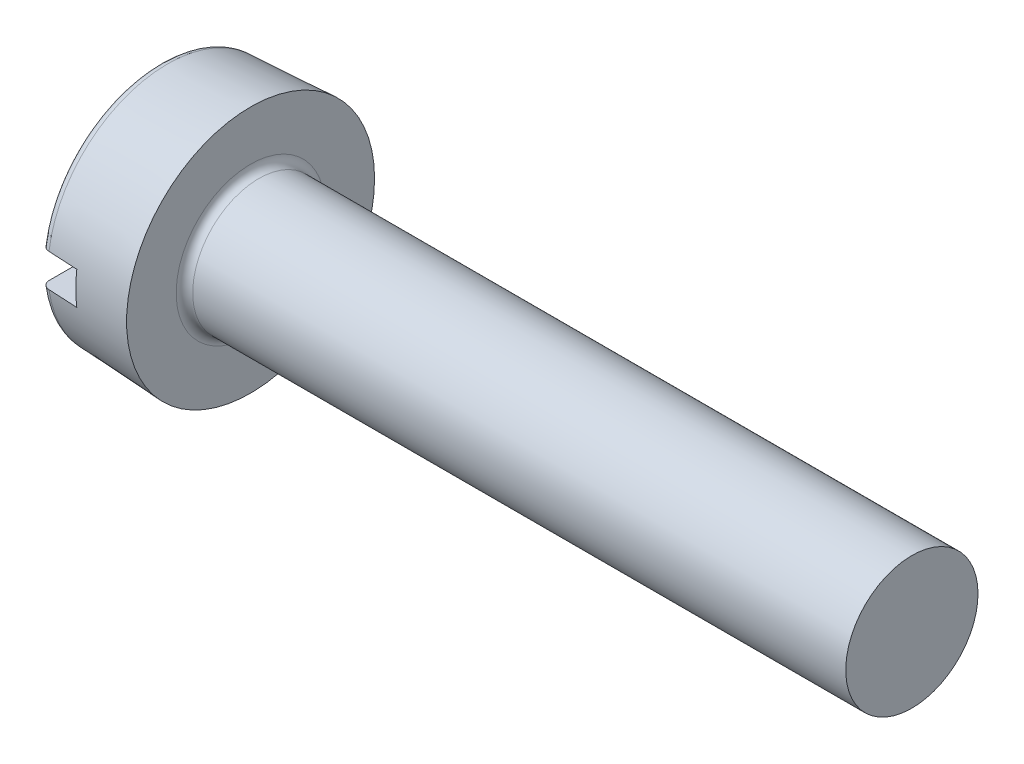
from build123d import *

# Parameters (mm, degrees)
SKETCH2_R       = 1.5
BASEHEAD_DEPTH  = 1.1
BASEHEAD_DRAFT  = -3
SKETCH3_R       = 0.8
BASEBODY_DEPTH  = 8
SLOT_DEPTH      = 12.610770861
SLOT_DEPTH_BACK = 12.610770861
SKETCH4_W       = 0.4
SKETCH4_H       = 0.45
HEADFILLET_R    = 0.1


with BuildPart() as part:
    # Sketch2 → BaseHead (with draft: the straight prism first)
    with BuildSketch(Plane(origin=(1.1, 0, 0), x_dir=(0, 0, -1), z_dir=(1, 0, 0))):
        Circle(SKETCH2_R)
    extrude(amount=-BASEHEAD_DEPTH)
    # BaseHead: the draft: its side faces are tilted about the plane it starts from
    basehead_sides = [part.faces().sort_by_distance(p)[0] for p in [
        (0.55, 0, 1.5),
    ]]
    draft(basehead_sides, Plane(origin=(1.1, 0, 0), x_dir=(0, 0, -1), z_dir=(1, 0, 0)), BASEHEAD_DRAFT)

    # Sketch3 → BaseBody (add)
    with BuildSketch(Plane(origin=(1.1, -1.110095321, -1.354392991), x_dir=(0, 0, -1), z_dir=(1, 0, 0))):
        with Locations((-1.354392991, 1.110095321)):
            Circle(SKETCH3_R)
    extrude(amount=BASEBODY_DEPTH)

    # Sketch4 → Slot (cut, two sides: drawn at the far end of the back side and taken through both)
    with BuildSketch(Plane(origin=(-1.9, -1.9, 0), x_dir=(0, 1, 0), z_dir=(0, 0, 1)).offset(-SLOT_DEPTH_BACK)):
        with Locations((1.9, -2.125)):
            Rectangle(SKETCH4_W, SKETCH4_H)
    extrude(amount=SLOT_DEPTH + SLOT_DEPTH_BACK, mode=Mode.SUBTRACT)

    # HeadFillet
    headfillet_edges = [part.edges().sort_by_distance(p)[0] for p in [
        (1.1, 0, 0.8),
        (0, -1.442351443, 0),
        (0, 1.442351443, 0),
    ]]
    fillet(headfillet_edges, radius=HEADFILLET_R)


solid = part.part
